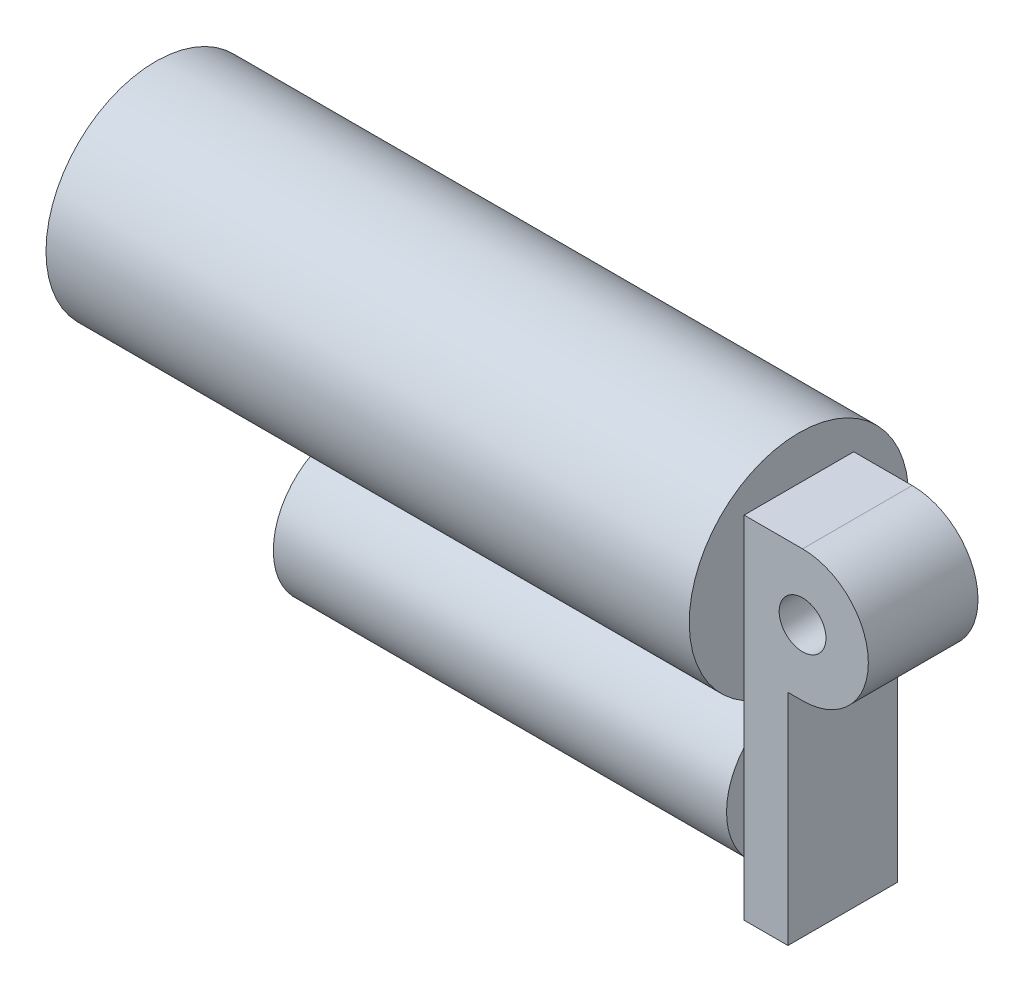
from build123d import *

# Parameters (mm, degrees)
SKETCH_1_R          = 1.6
EXTRUDE_1_DEPTH     = 3.75
SKETCH_2_R          = 7.5
SKETCH_2_R_2        = 4.95
EXTRUDE_3_DEPTH     = 44
CUT_EXTRUDE_START   = -13
SKETCH_3_R          = 4.95
CUT_EXTRUDE_1_DEPTH = 13


with BuildPart() as part:
    # Sketch 1 → Extrude 1 (new, symmetric)
    with BuildSketch(Plane.XY):
        with BuildLine():
            Line((0, 4.5), (-4, 4.5))
            Line((-4, 4.5), (-4, -4.5))
            Line((-4, -4.5), (-4, -19.5))
            Line((-4, -19.5), (-1, -19.5))
            Line((-1, -19.5), (-1, -4.5))
            Line((-1, -4.5), (0, -4.5))
            ThreePointArc((0, -4.5), (4.5, 0), (0, 4.5))
        make_face()
        Circle(SKETCH_1_R, mode=Mode.SUBTRACT)
    extrude(amount=EXTRUDE_1_DEPTH, both=True)

    # Sketch 2 → Extrude 3 (add)
    with BuildSketch(Plane.ZY.offset(4)):
        with Locations(Location((0, 0, 0), (0, 0, 240))):
            Circle(SKETCH_2_R)
        with Locations(Location((0, -12.5, 0), (0, 0, 139.250945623))):
            Circle(SKETCH_2_R_2)
    extrude(amount=EXTRUDE_3_DEPTH)

    # Sketch 3 → Cut-Extrude 1 (cut)
    with BuildSketch(Plane.ZY.offset(48).offset(CUT_EXTRUDE_START)):
        with Locations(Location((0, -12.5, 0), (0, 0, 139.250945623))):
            Circle(SKETCH_3_R)
    extrude(amount=CUT_EXTRUDE_1_DEPTH, mode=Mode.SUBTRACT)


solid = part.part
